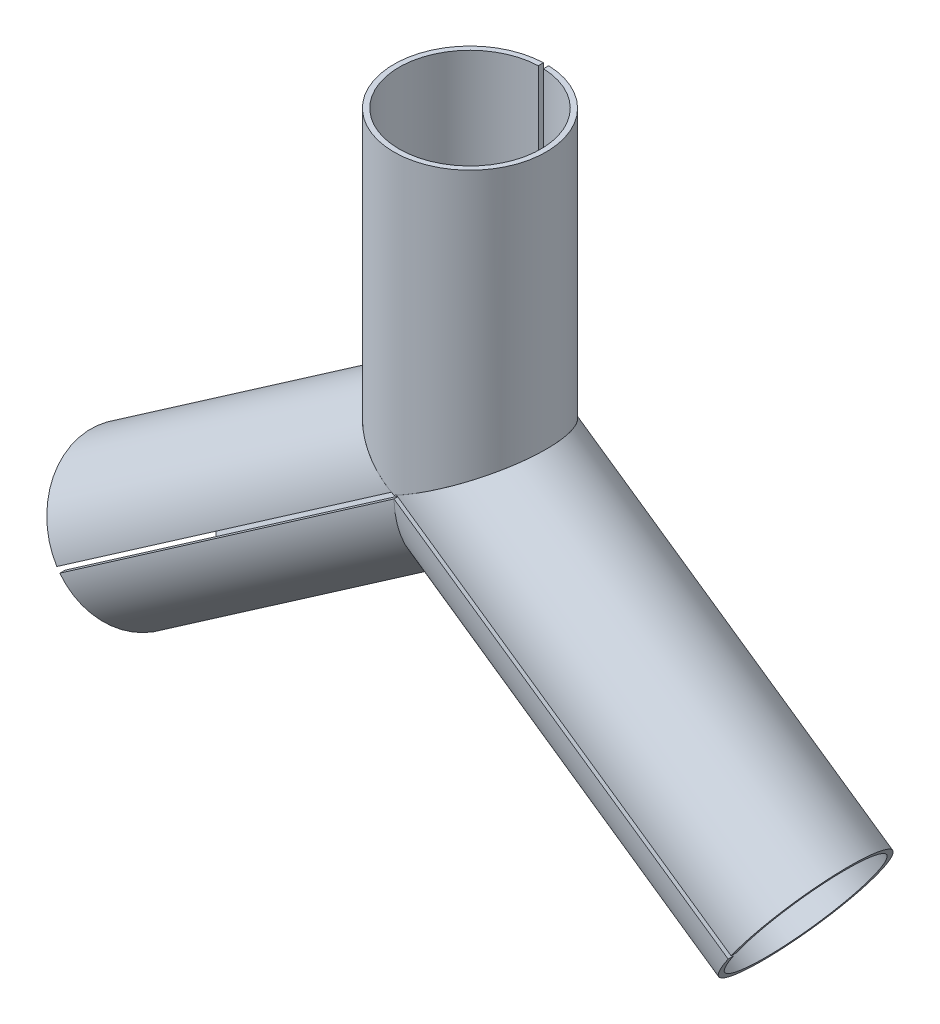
from build123d import *

# Parameters (mm, degrees)
SKETCH_2_R               = 14.676875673
SKETCH_2_R_2             = 13.676875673
EXTRUDE_1_DEPTH          = 57.343303
SKETCH_3_R               = 14.676875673
SKETCH_3_R_2             = 13.676875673
EXTRUDE_2_DEPTH          = 78.756698
CUT_EXTRUDE_1_DEPTH      = 95.063549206
CUT_EXTRUDE_1_DEPTH_BACK = 95.063549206
CUT_EXTRUDE_2_DEPTH      = 95.063549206
CUT_EXTRUDE_2_DEPTH_BACK = 95.063549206
SKETCH_6_W               = 14.676875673
SKETCH_6_H               = 1
CUT_EXTRUDE_1_2_DEPTH    = 131.246877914
SKETCH_1_W               = 1
SKETCH_1_H               = 57.343302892
CUT_EXTRUDE_2_2_DEPTH    = 95.063549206


with BuildPart() as part:
    # Sketch 2 → Extrude 1 (new body)
    with BuildSketch(Plane(origin=(0, 0, 0), x_dir=(1, 0, 0), z_dir=(0, 1, 0))):
        Circle(SKETCH_2_R)
        Circle(SKETCH_2_R_2, mode=Mode.SUBTRACT)
    extrude(amount=EXTRUDE_1_DEPTH)

    # Sketch 4 → Cut-Extrude 1 (cut, two sides: drawn at the far end of the back side and taken through both)
    with BuildSketch(Plane.XY.offset(-CUT_EXTRUDE_1_DEPTH_BACK)):
        Polygon((-29.353751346, 15.37841956), (0, 0), (29.353751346, 15.37841956), (29.353751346, -44.834515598), (-29.353751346, -44.834515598), align=None)
    extrude(amount=CUT_EXTRUDE_1_DEPTH + CUT_EXTRUDE_1_DEPTH_BACK, mode=Mode.SUBTRACT)

    # Sketch 1 → Cut-Extrude 2 2 (cut, through all)
    with BuildSketch(Plane.XY):
        with Locations((0, 28.671651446)):
            Rectangle(SKETCH_1_W, SKETCH_1_H)
    extrude(amount=-CUT_EXTRUDE_2_2_DEPTH, mode=Mode.SUBTRACT)


with BuildPart() as body_2:
    # Sketch 3 → Extrude 2 (new body)
    with BuildSketch(Plane(origin=(64.749391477, -44.834515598, 0), x_dir=(0, 0, -1), z_dir=(0.8221445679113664, -0.5692787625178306, 0))):
        Circle(SKETCH_3_R)
        Circle(SKETCH_3_R_2, mode=Mode.SUBTRACT)
    extrude(amount=-EXTRUDE_2_DEPTH)

    # Sketch 5 → Cut-Extrude 2 (cut, two sides: drawn at the far end of the back side and taken through both)
    with BuildSketch(Plane.XY.offset(-CUT_EXTRUDE_2_DEPTH_BACK)):
        Polygon((29.353751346, 15.37841956), (0, 0), (0, -44.834515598), (-14.676875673, -44.834515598), (-14.676875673, 15.37841956), align=None)
    extrude(amount=CUT_EXTRUDE_2_DEPTH + CUT_EXTRUDE_2_DEPTH_BACK, mode=Mode.SUBTRACT)

    # Sketch 6 → Cut-Extrude 1 2 (cut, through all)
    with BuildSketch(Plane(origin=(64.749391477, -44.834515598, 0), x_dir=(0, 0, -1), z_dir=(0.8221445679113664, -0.5692787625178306, 0))):
        with Locations((-7.338437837, 0)):
            Rectangle(SKETCH_6_W, SKETCH_6_H)
    extrude(amount=-CUT_EXTRUDE_1_2_DEPTH, mode=Mode.SUBTRACT)


with BuildPart() as body_3:
    # Mirror 1: mirrored copy
    add(body_2.part.mirror(Plane(origin=(0, 0, 0), x_dir=(0, 0, 1), z_dir=(1, 0, 0))))


solid = Compound([part.part, body_2.part, body_3.part])
